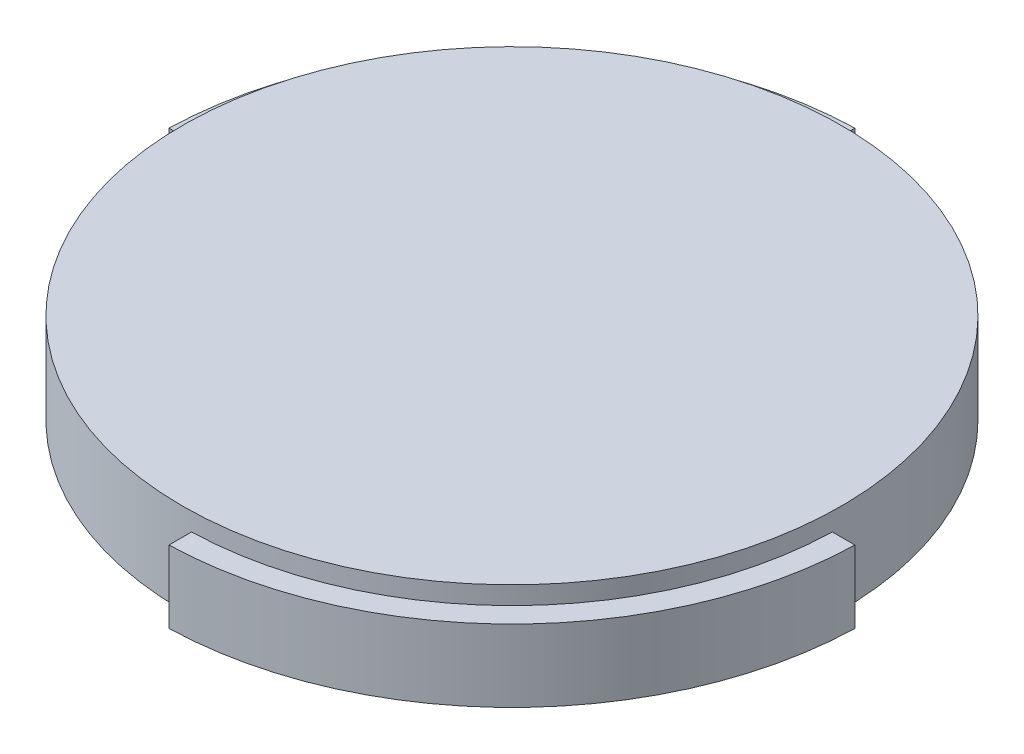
ISO-10303-21;
HEADER;
FILE_DESCRIPTION(('STEP AP214'),'2;1');
FILE_NAME('part.step','',(''),(''),'','','');
FILE_SCHEMA(('AUTOMOTIVE_DESIGN { 1 0 10303 214 1 1 1 1 }'));
ENDSEC;
DATA;
#1=APPLICATION_CONTEXT('core data for automotive mechanical design processes');
#2=APPLICATION_PROTOCOL_DEFINITION('international standard','automotive_design',2000,#1);
#3=PRODUCT_CONTEXT('',#1,'mechanical');
#4=PRODUCT('Part','Part','',(#3));
#5=PRODUCT_RELATED_PRODUCT_CATEGORY('part','',(#4));
#6=PRODUCT_DEFINITION_FORMATION('','',#4);
#7=PRODUCT_DEFINITION_CONTEXT('part definition',#1,'design');
#8=PRODUCT_DEFINITION('design','',#6,#7);
#9=PRODUCT_DEFINITION_SHAPE('','',#8);
#10=(LENGTH_UNIT() NAMED_UNIT(*) SI_UNIT(.MILLI.,.METRE.));
#11=(NAMED_UNIT(*) PLANE_ANGLE_UNIT() SI_UNIT($,.RADIAN.));
#12=(NAMED_UNIT(*) SI_UNIT($,.STERADIAN.) SOLID_ANGLE_UNIT());
#13=UNCERTAINTY_MEASURE_WITH_UNIT(LENGTH_MEASURE(1.E-05),#10,'distance_accuracy_value','');
#14=(GEOMETRIC_REPRESENTATION_CONTEXT(3) GLOBAL_UNCERTAINTY_ASSIGNED_CONTEXT((#13)) GLOBAL_UNIT_ASSIGNED_CONTEXT((#10,
#11,#12)) REPRESENTATION_CONTEXT('',''));
#15=CARTESIAN_POINT('',(0.,0.,0.));
#16=DIRECTION('',(0.,0.,1.));
#17=DIRECTION('',(1.,0.,0.));
#18=AXIS2_PLACEMENT_3D('',#15,#16,#17);
#19=CARTESIAN_POINT('',(0.,10.,0.));
#20=DIRECTION('',(0.,-1.,0.));
#21=DIRECTION('',(0.,0.,-1.));
#22=AXIS2_PLACEMENT_3D('',#19,#20,#21);
#23=CYLINDRICAL_SURFACE('',#22,39.);
#24=CARTESIAN_POINT('',(0.,8.,0.));
#25=DIRECTION('',(0.,1.,0.));
#26=DIRECTION('',(0.,0.,1.));
#27=AXIS2_PLACEMENT_3D('',#24,#25,#26);
#28=CIRCLE('',#27,39.);
#29=CARTESIAN_POINT('',(1.,8.,38.9871773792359));
#30=VERTEX_POINT('',#29);
#31=CARTESIAN_POINT('',(38.9871773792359,8.,1.));
#32=VERTEX_POINT('',#31);
#33=EDGE_CURVE('E151',#30,#32,#28,.T.);
#34=ORIENTED_EDGE('',*,*,#33,.F.);
#35=DIRECTION('',(0.,1.,0.));
#36=VECTOR('',#35,1.);
#37=CARTESIAN_POINT('',(1.,0.,38.9871773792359));
#38=LINE('',#37,#36);
#39=CARTESIAN_POINT('',(1.,0.,38.9871773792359));
#40=VERTEX_POINT('',#39);
#41=EDGE_CURVE('E123',#40,#30,#38,.T.);
#42=ORIENTED_EDGE('',*,*,#41,.F.);
#43=CARTESIAN_POINT('',(0.,0.,0.));
#44=DIRECTION('',(0.,1.,0.));
#45=DIRECTION('',(0.,0.,1.));
#46=AXIS2_PLACEMENT_3D('',#43,#44,#45);
#47=CIRCLE('',#46,39.);
#48=CARTESIAN_POINT('',(38.9871773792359,0.,1.));
#49=VERTEX_POINT('',#48);
#50=EDGE_CURVE('E40',#40,#49,#47,.T.);
#51=ORIENTED_EDGE('',*,*,#50,.T.);
#52=DIRECTION('',(0.,1.,0.));
#53=VECTOR('',#52,1.);
#54=CARTESIAN_POINT('',(38.9871773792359,0.,1.));
#55=LINE('',#54,#53);
#56=EDGE_CURVE('E134',#49,#32,#55,.T.);
#57=ORIENTED_EDGE('',*,*,#56,.T.);
#58=EDGE_LOOP('',(#34,#42,#51,#57));
#59=FACE_BOUND('',#58,.T.);
#60=ADVANCED_FACE('F32',(#59),#23,.T.);
#61=CARTESIAN_POINT('',(-1.,0.,-38.9871773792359));
#62=VERTEX_POINT('',#61);
#63=CARTESIAN_POINT('',(-38.9871797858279,0.,-0.999906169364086));
#64=VERTEX_POINT('',#63);
#65=EDGE_CURVE('E11',#62,#64,#47,.T.);
#66=ORIENTED_EDGE('',*,*,#65,.T.);
#67=DIRECTION('',(0.,1.,0.));
#68=VECTOR('',#67,1.);
#69=CARTESIAN_POINT('',(-38.9871797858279,0.,-0.999906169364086));
#70=LINE('',#69,#68);
#71=CARTESIAN_POINT('',(-38.9871797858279,8.,-0.999906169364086));
#72=VERTEX_POINT('',#71);
#73=EDGE_CURVE('E105',#64,#72,#70,.T.);
#74=ORIENTED_EDGE('',*,*,#73,.T.);
#75=CARTESIAN_POINT('',(0.,8.,0.));
#76=DIRECTION('',(0.,1.,0.));
#77=DIRECTION('',(0.,0.,1.));
#78=AXIS2_PLACEMENT_3D('',#75,#76,#77);
#79=CIRCLE('',#78,39.);
#80=CARTESIAN_POINT('',(-1.,8.,-38.9871773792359));
#81=VERTEX_POINT('',#80);
#82=EDGE_CURVE('E145',#81,#72,#79,.T.);
#83=ORIENTED_EDGE('',*,*,#82,.F.);
#84=DIRECTION('',(0.,1.,0.));
#85=VECTOR('',#84,1.);
#86=CARTESIAN_POINT('',(-1.,0.,-38.9871773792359));
#87=LINE('',#86,#85);
#88=EDGE_CURVE('E55',#62,#81,#87,.T.);
#89=ORIENTED_EDGE('',*,*,#88,.F.);
#90=EDGE_LOOP('',(#66,#74,#83,#89));
#91=FACE_BOUND('',#90,.T.);
#92=ADVANCED_FACE('F34',(#91),#23,.T.);
#93=CARTESIAN_POINT('',(0.,10.,0.));
#94=DIRECTION('',(0.,1.,0.));
#95=DIRECTION('',(0.,0.,1.));
#96=AXIS2_PLACEMENT_3D('',#93,#94,#95);
#97=PLANE('',#96);
#98=CARTESIAN_POINT('',(0.,10.,0.));
#99=DIRECTION('',(0.,-1.,0.));
#100=DIRECTION('',(0.,0.,1.));
#101=AXIS2_PLACEMENT_3D('',#98,#99,#100);
#102=CIRCLE('',#101,36.5);
#103=CARTESIAN_POINT('',(0.,10.,36.5));
#104=VERTEX_POINT('',#103);
#105=EDGE_CURVE('E150',#104,#104,#102,.T.);
#106=ORIENTED_EDGE('',*,*,#105,.F.);
#107=EDGE_LOOP('',(#106));
#108=FACE_BOUND('',#107,.T.);
#109=ADVANCED_FACE('F166',(#108),#97,.T.);
#110=CARTESIAN_POINT('',(0.,0.,0.));
#111=DIRECTION('',(0.,1.,0.));
#112=DIRECTION('',(0.,0.,1.));
#113=AXIS2_PLACEMENT_3D('',#110,#111,#112);
#114=PLANE('',#113);
#115=ORIENTED_EDGE('',*,*,#50,.F.);
#116=DIRECTION('',(0.,0.,-1.));
#117=VECTOR('',#116,1.);
#118=CARTESIAN_POINT('',(1.00000000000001,0.,36.4862987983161));
#119=LINE('',#118,#117);
#120=CARTESIAN_POINT('',(1.00000000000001,0.,36.4862987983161));
#121=VERTEX_POINT('',#120);
#122=EDGE_CURVE('E106',#40,#121,#119,.T.);
#123=ORIENTED_EDGE('',*,*,#122,.T.);
#124=CARTESIAN_POINT('',(0.,0.,0.));
#125=DIRECTION('',(0.,-1.,0.));
#126=DIRECTION('',(0.,0.,1.));
#127=AXIS2_PLACEMENT_3D('',#124,#125,#126);
#128=CIRCLE('',#127,36.5);
#129=CARTESIAN_POINT('',(-36.486301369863,0.,-0.999906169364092));
#130=VERTEX_POINT('',#129);
#131=EDGE_CURVE('E99',#121,#130,#128,.T.);
#132=ORIENTED_EDGE('',*,*,#131,.T.);
#133=DIRECTION('',(-1.,0.,0.));
#134=VECTOR('',#133,1.);
#135=CARTESIAN_POINT('',(-36.486301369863,0.,-0.999906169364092));
#136=LINE('',#135,#134);
#137=EDGE_CURVE('E109',#130,#64,#136,.T.);
#138=ORIENTED_EDGE('',*,*,#137,.T.);
#139=ORIENTED_EDGE('',*,*,#65,.F.);
#140=DIRECTION('',(0.,0.,1.));
#141=VECTOR('',#140,1.);
#142=CARTESIAN_POINT('',(-1.,0.,-38.9871773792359));
#143=LINE('',#142,#141);
#144=CARTESIAN_POINT('',(-1.,0.,-36.4862987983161));
#145=VERTEX_POINT('',#144);
#146=EDGE_CURVE('E122',#62,#145,#143,.T.);
#147=ORIENTED_EDGE('',*,*,#146,.T.);
#148=CARTESIAN_POINT('',(0.,0.,0.));
#149=DIRECTION('',(0.,-1.,0.));
#150=DIRECTION('',(0.,0.,1.));
#151=AXIS2_PLACEMENT_3D('',#148,#149,#150);
#152=CIRCLE('',#151,36.5);
#153=CARTESIAN_POINT('',(36.4862987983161,0.,0.999999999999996));
#154=VERTEX_POINT('',#153);
#155=EDGE_CURVE('E128',#145,#154,#152,.T.);
#156=ORIENTED_EDGE('',*,*,#155,.T.);
#157=DIRECTION('',(1.,0.,0.));
#158=VECTOR('',#157,1.);
#159=CARTESIAN_POINT('',(38.9871773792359,0.,1.));
#160=LINE('',#159,#158);
#161=EDGE_CURVE('E131',#154,#49,#160,.T.);
#162=ORIENTED_EDGE('',*,*,#161,.T.);
#163=EDGE_LOOP('',(#115,#123,#132,#138,#139,#147,#156,#162));
#164=FACE_BOUND('',#163,.T.);
#165=ADVANCED_FACE('F116',(#164),#114,.F.);
#166=CARTESIAN_POINT('',(0.,8.,0.));
#167=DIRECTION('',(0.,1.,0.));
#168=DIRECTION('',(0.,0.,1.));
#169=AXIS2_PLACEMENT_3D('',#166,#167,#168);
#170=CYLINDRICAL_SURFACE('',#169,36.5);
#171=ORIENTED_EDGE('',*,*,#105,.T.);
#172=EDGE_LOOP('',(#171));
#173=FACE_BOUND('',#172,.T.);
#174=DIRECTION('',(0.,1.,0.));
#175=VECTOR('',#174,1.);
#176=CARTESIAN_POINT('',(1.00000000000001,0.,36.4862987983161));
#177=LINE('',#176,#175);
#178=CARTESIAN_POINT('',(1.00000000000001,8.,36.4862987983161));
#179=VERTEX_POINT('',#178);
#180=EDGE_CURVE('E120',#121,#179,#177,.T.);
#181=ORIENTED_EDGE('',*,*,#180,.T.);
#182=CARTESIAN_POINT('',(0.,8.,0.));
#183=DIRECTION('',(0.,-1.,0.));
#184=DIRECTION('',(0.,0.,1.));
#185=AXIS2_PLACEMENT_3D('',#182,#183,#184);
#186=CIRCLE('',#185,36.5);
#187=CARTESIAN_POINT('',(36.4862987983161,8.,0.999999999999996));
#188=VERTEX_POINT('',#187);
#189=EDGE_CURVE('E157',#188,#179,#186,.T.);
#190=ORIENTED_EDGE('',*,*,#189,.F.);
#191=DIRECTION('',(0.,1.,0.));
#192=VECTOR('',#191,1.);
#193=CARTESIAN_POINT('',(36.4862987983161,0.,0.999999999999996));
#194=LINE('',#193,#192);
#195=EDGE_CURVE('E137',#154,#188,#194,.T.);
#196=ORIENTED_EDGE('',*,*,#195,.F.);
#197=ORIENTED_EDGE('',*,*,#155,.F.);
#198=DIRECTION('',(0.,1.,0.));
#199=VECTOR('',#198,1.);
#200=CARTESIAN_POINT('',(-1.,0.,-36.4862987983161));
#201=LINE('',#200,#199);
#202=CARTESIAN_POINT('',(-1.,8.,-36.4862987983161));
#203=VERTEX_POINT('',#202);
#204=EDGE_CURVE('E139',#145,#203,#201,.T.);
#205=ORIENTED_EDGE('',*,*,#204,.T.);
#206=CARTESIAN_POINT('',(0.,8.,0.));
#207=DIRECTION('',(0.,-1.,0.));
#208=DIRECTION('',(0.,0.,1.));
#209=AXIS2_PLACEMENT_3D('',#206,#207,#208);
#210=CIRCLE('',#209,36.5);
#211=CARTESIAN_POINT('',(-36.486301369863,8.,-0.999906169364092));
#212=VERTEX_POINT('',#211);
#213=EDGE_CURVE('E103',#212,#203,#210,.T.);
#214=ORIENTED_EDGE('',*,*,#213,.F.);
#215=DIRECTION('',(0.,1.,0.));
#216=VECTOR('',#215,1.);
#217=CARTESIAN_POINT('',(-36.486301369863,0.,-0.999906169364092));
#218=LINE('',#217,#216);
#219=EDGE_CURVE('E47',#130,#212,#218,.T.);
#220=ORIENTED_EDGE('',*,*,#219,.F.);
#221=ORIENTED_EDGE('',*,*,#131,.F.);
#222=EDGE_LOOP('',(#181,#190,#196,#197,#205,#214,#220,#221));
#223=FACE_BOUND('',#222,.T.);
#224=ADVANCED_FACE('F97',(#173,#223),#170,.T.);
#225=CARTESIAN_POINT('',(0.,8.,0.));
#226=DIRECTION('',(0.,1.,0.));
#227=DIRECTION('',(0.,0.,1.));
#228=AXIS2_PLACEMENT_3D('',#225,#226,#227);
#229=PLANE('',#228);
#230=ORIENTED_EDGE('',*,*,#33,.T.);
#231=DIRECTION('',(-1.,0.,0.));
#232=VECTOR('',#231,1.);
#233=CARTESIAN_POINT('',(38.9871773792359,8.,1.));
#234=LINE('',#233,#232);
#235=EDGE_CURVE('E154',#32,#188,#234,.T.);
#236=ORIENTED_EDGE('',*,*,#235,.T.);
#237=ORIENTED_EDGE('',*,*,#189,.T.);
#238=DIRECTION('',(0.,0.,1.));
#239=VECTOR('',#238,1.);
#240=CARTESIAN_POINT('',(1.00000000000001,8.,38.9871773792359));
#241=LINE('',#240,#239);
#242=EDGE_CURVE('E160',#179,#30,#241,.T.);
#243=ORIENTED_EDGE('',*,*,#242,.T.);
#244=EDGE_LOOP('',(#230,#236,#237,#243));
#245=FACE_BOUND('',#244,.T.);
#246=ADVANCED_FACE('F183',(#245),#229,.T.);
#247=CARTESIAN_POINT('',(0.,8.,0.));
#248=DIRECTION('',(0.,1.,0.));
#249=DIRECTION('',(0.,0.,1.));
#250=AXIS2_PLACEMENT_3D('',#247,#248,#249);
#251=PLANE('',#250);
#252=ORIENTED_EDGE('',*,*,#213,.T.);
#253=DIRECTION('',(0.,0.,-1.));
#254=VECTOR('',#253,1.);
#255=CARTESIAN_POINT('',(-1.,8.,-38.9871773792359));
#256=LINE('',#255,#254);
#257=EDGE_CURVE('E143',#203,#81,#256,.T.);
#258=ORIENTED_EDGE('',*,*,#257,.T.);
#259=ORIENTED_EDGE('',*,*,#82,.T.);
#260=DIRECTION('',(1.,0.,0.));
#261=VECTOR('',#260,1.);
#262=CARTESIAN_POINT('',(-36.486301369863,8.,-0.999906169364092));
#263=LINE('',#262,#261);
#264=EDGE_CURVE('E148',#72,#212,#263,.T.);
#265=ORIENTED_EDGE('',*,*,#264,.T.);
#266=EDGE_LOOP('',(#252,#258,#259,#265));
#267=FACE_BOUND('',#266,.T.);
#268=ADVANCED_FACE('F194',(#267),#251,.T.);
#269=CARTESIAN_POINT('',(38.9871773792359,0.,1.));
#270=DIRECTION('',(0.,0.,1.));
#271=DIRECTION('',(1.,0.,0.));
#272=AXIS2_PLACEMENT_3D('',#269,#270,#271);
#273=PLANE('',#272);
#274=ORIENTED_EDGE('',*,*,#235,.F.);
#275=ORIENTED_EDGE('',*,*,#56,.F.);
#276=ORIENTED_EDGE('',*,*,#161,.F.);
#277=ORIENTED_EDGE('',*,*,#195,.T.);
#278=EDGE_LOOP('',(#274,#275,#276,#277));
#279=FACE_BOUND('',#278,.T.);
#280=ADVANCED_FACE('F190',(#279),#273,.F.);
#281=CARTESIAN_POINT('',(-1.,0.,-38.9871773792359));
#282=DIRECTION('',(-1.,0.,0.));
#283=DIRECTION('',(0.,0.,1.));
#284=AXIS2_PLACEMENT_3D('',#281,#282,#283);
#285=PLANE('',#284);
#286=ORIENTED_EDGE('',*,*,#257,.F.);
#287=ORIENTED_EDGE('',*,*,#204,.F.);
#288=ORIENTED_EDGE('',*,*,#146,.F.);
#289=ORIENTED_EDGE('',*,*,#88,.T.);
#290=EDGE_LOOP('',(#286,#287,#288,#289));
#291=FACE_BOUND('',#290,.T.);
#292=ADVANCED_FACE('F191',(#291),#285,.F.);
#293=CARTESIAN_POINT('',(1.00000000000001,0.,36.4862987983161));
#294=DIRECTION('',(1.,0.,0.));
#295=DIRECTION('',(0.,0.,-1.));
#296=AXIS2_PLACEMENT_3D('',#293,#294,#295);
#297=PLANE('',#296);
#298=ORIENTED_EDGE('',*,*,#242,.F.);
#299=ORIENTED_EDGE('',*,*,#180,.F.);
#300=ORIENTED_EDGE('',*,*,#122,.F.);
#301=ORIENTED_EDGE('',*,*,#41,.T.);
#302=EDGE_LOOP('',(#298,#299,#300,#301));
#303=FACE_BOUND('',#302,.T.);
#304=ADVANCED_FACE('F186',(#303),#297,.F.);
#305=CARTESIAN_POINT('',(-36.486301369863,0.,-0.999906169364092));
#306=DIRECTION('',(0.,0.,-1.));
#307=DIRECTION('',(-1.,0.,0.));
#308=AXIS2_PLACEMENT_3D('',#305,#306,#307);
#309=PLANE('',#308);
#310=ORIENTED_EDGE('',*,*,#264,.F.);
#311=ORIENTED_EDGE('',*,*,#73,.F.);
#312=ORIENTED_EDGE('',*,*,#137,.F.);
#313=ORIENTED_EDGE('',*,*,#219,.T.);
#314=EDGE_LOOP('',(#310,#311,#312,#313));
#315=FACE_BOUND('',#314,.T.);
#316=ADVANCED_FACE('F110',(#315),#309,.F.);
#317=CLOSED_SHELL('',(#60,#92,#109,#165,#224,#246,#268,#280,#292,#304,#316));
#318=MANIFOLD_SOLID_BREP('B2',#317);
#319=ADVANCED_BREP_SHAPE_REPRESENTATION('',(#18,#318),#14);
#320=SHAPE_DEFINITION_REPRESENTATION(#9,#319);
ENDSEC;
END-ISO-10303-21;
